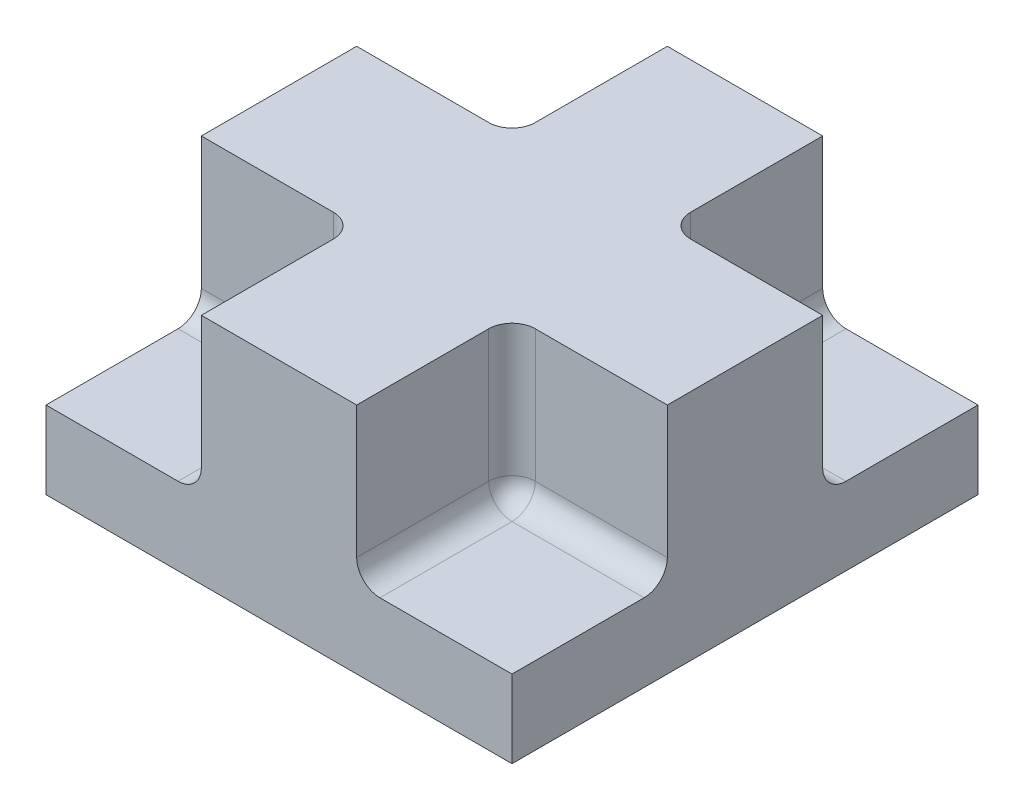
from build123d import *

# Parameters (mm, degrees)
SKETCH1_W          = 60
SKETCH1_H          = 60
EXTRUDE1_DEPTH     = 30
SKETCH2_W          = 20
SKETCH2_H          = 20
CUT_EXTRUDE1_DEPTH = 20
FILLET1_R          = 3


with BuildPart() as part:
    # Sketch1 → Extrude1 (new body)
    with BuildSketch(Plane(origin=(0, 0, 0), x_dir=(1, 0, 0), z_dir=(0, 1, 0))):
        with Locations((30, 30)):
            Rectangle(SKETCH1_W, SKETCH1_H)
    extrude(amount=EXTRUDE1_DEPTH)

    # Sketch2 → Cut-Extrude1 (cut)
    with BuildSketch(Plane(origin=(0, 30, 0), x_dir=(-1, 0, 0), z_dir=(0, 1, 0))):
        with Locations((-10, -10)):
            Rectangle(SKETCH2_W, SKETCH2_H)
        with Locations((-10, -50)):
            Rectangle(SKETCH2_W, SKETCH2_H)
        with Locations((-50, -50)):
            Rectangle(SKETCH2_W, SKETCH2_H)
        with Locations((-50, -10)):
            Rectangle(SKETCH2_W, SKETCH2_H)
    extrude(amount=-CUT_EXTRUDE1_DEPTH, mode=Mode.SUBTRACT)

    # Fillet1
    fillet1_edges = [part.edges().sort_by_distance(p)[0] for p in [
        (10, 10, -20),
        (20, 10, -10),
        (20, 20, -20),
        (20, 10, -50),
        (10, 10, -40),
        (20, 20, -40),
        (50, 10, -40),
        (40, 10, -50),
        (40, 20, -40),
        (40, 10, -10),
        (50, 10, -20),
        (40, 20, -20),
    ]]
    fillet(fillet1_edges, radius=FILLET1_R)


solid = part.part
